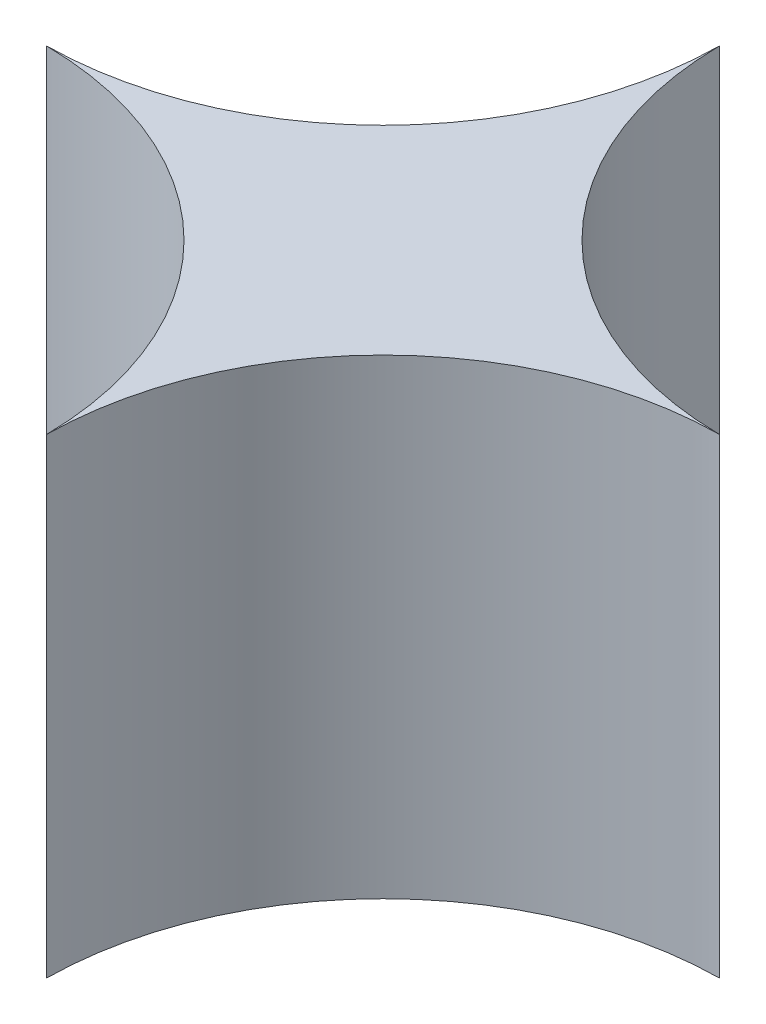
ISO-10303-21;
HEADER;
FILE_DESCRIPTION(('STEP AP214'),'2;1');
FILE_NAME('part.step','',(''),(''),'','','');
FILE_SCHEMA(('AUTOMOTIVE_DESIGN { 1 0 10303 214 1 1 1 1 }'));
ENDSEC;
DATA;
#1=APPLICATION_CONTEXT('core data for automotive mechanical design processes');
#2=APPLICATION_PROTOCOL_DEFINITION('international standard','automotive_design',2000,#1);
#3=PRODUCT_CONTEXT('',#1,'mechanical');
#4=PRODUCT('Part','Part','',(#3));
#5=PRODUCT_RELATED_PRODUCT_CATEGORY('part','',(#4));
#6=PRODUCT_DEFINITION_FORMATION('','',#4);
#7=PRODUCT_DEFINITION_CONTEXT('part definition',#1,'design');
#8=PRODUCT_DEFINITION('design','',#6,#7);
#9=PRODUCT_DEFINITION_SHAPE('','',#8);
#10=(LENGTH_UNIT() NAMED_UNIT(*) SI_UNIT(.MILLI.,.METRE.));
#11=(NAMED_UNIT(*) PLANE_ANGLE_UNIT() SI_UNIT($,.RADIAN.));
#12=(NAMED_UNIT(*) SI_UNIT($,.STERADIAN.) SOLID_ANGLE_UNIT());
#13=UNCERTAINTY_MEASURE_WITH_UNIT(LENGTH_MEASURE(1.E-05),#10,'distance_accuracy_value','');
#14=(GEOMETRIC_REPRESENTATION_CONTEXT(3) GLOBAL_UNCERTAINTY_ASSIGNED_CONTEXT((#13)) GLOBAL_UNIT_ASSIGNED_CONTEXT((#10,
#11,#12)) REPRESENTATION_CONTEXT('',''));
#15=CARTESIAN_POINT('',(0.,0.,0.));
#16=DIRECTION('',(0.,0.,1.));
#17=DIRECTION('',(1.,0.,0.));
#18=AXIS2_PLACEMENT_3D('',#15,#16,#17);
#19=CARTESIAN_POINT('',(-22.725,33.25,22.725));
#20=DIRECTION('',(0.,-1.,0.));
#21=DIRECTION('',(0.,0.,-1.));
#22=AXIS2_PLACEMENT_3D('',#19,#20,#21);
#23=CYLINDRICAL_SURFACE('',#22,22.725);
#24=CARTESIAN_POINT('',(-22.725,1.75,22.725));
#25=DIRECTION('',(0.,1.,0.));
#26=DIRECTION('',(0.,0.,1.));
#27=AXIS2_PLACEMENT_3D('',#24,#25,#26);
#28=CIRCLE('',#27,22.725);
#29=CARTESIAN_POINT('',(-0.00111388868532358,1.75,22.5));
#30=VERTEX_POINT('',#29);
#31=CARTESIAN_POINT('',(-22.5,1.75,0.00111388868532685));
#32=VERTEX_POINT('',#31);
#33=EDGE_CURVE('E140',#30,#32,#28,.T.);
#34=ORIENTED_EDGE('',*,*,#33,.F.);
#35=DIRECTION('',(0.,-1.,0.));
#36=VECTOR('',#35,1.);
#37=CARTESIAN_POINT('',(-0.00111388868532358,33.25,22.5));
#38=LINE('',#37,#36);
#39=CARTESIAN_POINT('',(-0.00111388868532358,33.25,22.5));
#40=VERTEX_POINT('',#39);
#41=EDGE_CURVE('E11',#40,#30,#38,.T.);
#42=ORIENTED_EDGE('',*,*,#41,.F.);
#43=CARTESIAN_POINT('',(-22.725,33.25,22.725));
#44=DIRECTION('',(0.,1.,0.));
#45=DIRECTION('',(0.,0.,1.));
#46=AXIS2_PLACEMENT_3D('',#43,#44,#45);
#47=CIRCLE('',#46,22.725);
#48=CARTESIAN_POINT('',(-22.5,33.25,0.00111388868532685));
#49=VERTEX_POINT('',#48);
#50=EDGE_CURVE('E168',#40,#49,#47,.T.);
#51=ORIENTED_EDGE('',*,*,#50,.T.);
#52=DIRECTION('',(0.,-1.,0.));
#53=VECTOR('',#52,1.);
#54=CARTESIAN_POINT('',(-22.5,33.25,0.00111388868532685));
#55=LINE('',#54,#53);
#56=EDGE_CURVE('E59',#49,#32,#55,.T.);
#57=ORIENTED_EDGE('',*,*,#56,.T.);
#58=EDGE_LOOP('',(#34,#42,#51,#57));
#59=FACE_BOUND('',#58,.T.);
#60=ADVANCED_FACE('F42',(#59),#23,.F.);
#61=CARTESIAN_POINT('',(0.,33.25,22.5));
#62=DIRECTION('',(0.,0.,-1.));
#63=DIRECTION('',(-1.,0.,0.));
#64=AXIS2_PLACEMENT_3D('',#61,#62,#63);
#65=PLANE('',#64);
#66=DIRECTION('',(1.,0.,0.));
#67=VECTOR('',#66,1.);
#68=CARTESIAN_POINT('',(0.,1.75,22.5));
#69=LINE('',#68,#67);
#70=CARTESIAN_POINT('',(0.00111388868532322,1.75,22.5));
#71=VERTEX_POINT('',#70);
#72=EDGE_CURVE('E143',#30,#71,#69,.T.);
#73=ORIENTED_EDGE('',*,*,#72,.T.);
#74=DIRECTION('',(0.,-1.,0.));
#75=VECTOR('',#74,1.);
#76=CARTESIAN_POINT('',(0.00111388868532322,33.25,22.5));
#77=LINE('',#76,#75);
#78=CARTESIAN_POINT('',(0.00111388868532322,33.25,22.5));
#79=VERTEX_POINT('',#78);
#80=EDGE_CURVE('E51',#79,#71,#77,.T.);
#81=ORIENTED_EDGE('',*,*,#80,.F.);
#82=DIRECTION('',(1.,0.,0.));
#83=VECTOR('',#82,1.);
#84=CARTESIAN_POINT('',(0.,33.25,22.5));
#85=LINE('',#84,#83);
#86=EDGE_CURVE('E202',#40,#79,#85,.T.);
#87=ORIENTED_EDGE('',*,*,#86,.F.);
#88=ORIENTED_EDGE('',*,*,#41,.T.);
#89=EDGE_LOOP('',(#73,#81,#87,#88));
#90=FACE_BOUND('',#89,.T.);
#91=ADVANCED_FACE('F190',(#90),#65,.F.);
#92=CARTESIAN_POINT('',(22.725,33.25,22.725));
#93=DIRECTION('',(0.,-1.,0.));
#94=DIRECTION('',(0.,0.,-1.));
#95=AXIS2_PLACEMENT_3D('',#92,#93,#94);
#96=CYLINDRICAL_SURFACE('',#95,22.725);
#97=CARTESIAN_POINT('',(22.725,1.75,22.725));
#98=DIRECTION('',(0.,1.,0.));
#99=DIRECTION('',(0.,0.,1.));
#100=AXIS2_PLACEMENT_3D('',#97,#98,#99);
#101=CIRCLE('',#100,22.725);
#102=CARTESIAN_POINT('',(22.5,1.75,0.00111388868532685));
#103=VERTEX_POINT('',#102);
#104=EDGE_CURVE('E147',#103,#71,#101,.T.);
#105=ORIENTED_EDGE('',*,*,#104,.F.);
#106=DIRECTION('',(0.,-1.,0.));
#107=VECTOR('',#106,1.);
#108=CARTESIAN_POINT('',(22.5,33.25,0.00111388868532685));
#109=LINE('',#108,#107);
#110=CARTESIAN_POINT('',(22.5,33.25,0.00111388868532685));
#111=VERTEX_POINT('',#110);
#112=EDGE_CURVE('E178',#111,#103,#109,.T.);
#113=ORIENTED_EDGE('',*,*,#112,.F.);
#114=CARTESIAN_POINT('',(22.725,33.25,22.725));
#115=DIRECTION('',(0.,1.,0.));
#116=DIRECTION('',(0.,0.,1.));
#117=AXIS2_PLACEMENT_3D('',#114,#115,#116);
#118=CIRCLE('',#117,22.725);
#119=EDGE_CURVE('E187',#111,#79,#118,.T.);
#120=ORIENTED_EDGE('',*,*,#119,.T.);
#121=ORIENTED_EDGE('',*,*,#80,.T.);
#122=EDGE_LOOP('',(#105,#113,#120,#121));
#123=FACE_BOUND('',#122,.T.);
#124=ADVANCED_FACE('F185',(#123),#96,.F.);
#125=CARTESIAN_POINT('',(22.5,33.25,0.));
#126=DIRECTION('',(-1.,0.,0.));
#127=DIRECTION('',(0.,0.,1.));
#128=AXIS2_PLACEMENT_3D('',#125,#126,#127);
#129=PLANE('',#128);
#130=DIRECTION('',(0.,0.,-1.));
#131=VECTOR('',#130,1.);
#132=CARTESIAN_POINT('',(22.5,1.75,0.));
#133=LINE('',#132,#131);
#134=CARTESIAN_POINT('',(22.5,1.75,-0.00111388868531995));
#135=VERTEX_POINT('',#134);
#136=EDGE_CURVE('E151',#103,#135,#133,.T.);
#137=ORIENTED_EDGE('',*,*,#136,.T.);
#138=DIRECTION('',(0.,-1.,0.));
#139=VECTOR('',#138,1.);
#140=CARTESIAN_POINT('',(22.5,33.25,-0.00111388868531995));
#141=LINE('',#140,#139);
#142=CARTESIAN_POINT('',(22.5,33.25,-0.00111388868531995));
#143=VERTEX_POINT('',#142);
#144=EDGE_CURVE('E175',#143,#135,#141,.T.);
#145=ORIENTED_EDGE('',*,*,#144,.F.);
#146=DIRECTION('',(0.,0.,-1.));
#147=VECTOR('',#146,1.);
#148=CARTESIAN_POINT('',(22.5,33.25,0.));
#149=LINE('',#148,#147);
#150=EDGE_CURVE('E199',#111,#143,#149,.T.);
#151=ORIENTED_EDGE('',*,*,#150,.F.);
#152=ORIENTED_EDGE('',*,*,#112,.T.);
#153=EDGE_LOOP('',(#137,#145,#151,#152));
#154=FACE_BOUND('',#153,.T.);
#155=ADVANCED_FACE('F197',(#154),#129,.F.);
#156=CARTESIAN_POINT('',(22.725,33.25,-22.725));
#157=DIRECTION('',(0.,-1.,0.));
#158=DIRECTION('',(0.,0.,-1.));
#159=AXIS2_PLACEMENT_3D('',#156,#157,#158);
#160=CYLINDRICAL_SURFACE('',#159,22.725);
#161=CARTESIAN_POINT('',(22.725,1.75,-22.725));
#162=DIRECTION('',(0.,1.,0.));
#163=DIRECTION('',(0.,0.,1.));
#164=AXIS2_PLACEMENT_3D('',#161,#162,#163);
#165=CIRCLE('',#164,22.725);
#166=CARTESIAN_POINT('',(0.00111388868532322,1.75,-22.5));
#167=VERTEX_POINT('',#166);
#168=EDGE_CURVE('E155',#167,#135,#165,.T.);
#169=ORIENTED_EDGE('',*,*,#168,.F.);
#170=DIRECTION('',(0.,-1.,0.));
#171=VECTOR('',#170,1.);
#172=CARTESIAN_POINT('',(0.00111388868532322,33.25,-22.5));
#173=LINE('',#172,#171);
#174=CARTESIAN_POINT('',(0.00111388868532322,33.25,-22.5));
#175=VERTEX_POINT('',#174);
#176=EDGE_CURVE('E119',#175,#167,#173,.T.);
#177=ORIENTED_EDGE('',*,*,#176,.F.);
#178=CARTESIAN_POINT('',(22.725,33.25,-22.725));
#179=DIRECTION('',(0.,1.,0.));
#180=DIRECTION('',(0.,0.,1.));
#181=AXIS2_PLACEMENT_3D('',#178,#179,#180);
#182=CIRCLE('',#181,22.725);
#183=EDGE_CURVE('E129',#175,#143,#182,.T.);
#184=ORIENTED_EDGE('',*,*,#183,.T.);
#185=ORIENTED_EDGE('',*,*,#144,.T.);
#186=EDGE_LOOP('',(#169,#177,#184,#185));
#187=FACE_BOUND('',#186,.T.);
#188=ADVANCED_FACE('F210',(#187),#160,.F.);
#189=CARTESIAN_POINT('',(0.,33.25,-22.5));
#190=DIRECTION('',(0.,0.,-1.));
#191=DIRECTION('',(-1.,0.,0.));
#192=AXIS2_PLACEMENT_3D('',#189,#190,#191);
#193=PLANE('',#192);
#194=DIRECTION('',(1.,0.,0.));
#195=VECTOR('',#194,1.);
#196=CARTESIAN_POINT('',(0.,1.75,-22.5));
#197=LINE('',#196,#195);
#198=CARTESIAN_POINT('',(-0.00111388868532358,1.75,-22.5));
#199=VERTEX_POINT('',#198);
#200=EDGE_CURVE('E114',#199,#167,#197,.T.);
#201=ORIENTED_EDGE('',*,*,#200,.F.);
#202=DIRECTION('',(0.,-1.,0.));
#203=VECTOR('',#202,1.);
#204=CARTESIAN_POINT('',(-0.00111388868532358,33.25,-22.5));
#205=LINE('',#204,#203);
#206=CARTESIAN_POINT('',(-0.00111388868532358,33.25,-22.5));
#207=VERTEX_POINT('',#206);
#208=EDGE_CURVE('E109',#207,#199,#205,.T.);
#209=ORIENTED_EDGE('',*,*,#208,.F.);
#210=DIRECTION('',(1.,0.,0.));
#211=VECTOR('',#210,1.);
#212=CARTESIAN_POINT('',(0.,33.25,-22.5));
#213=LINE('',#212,#211);
#214=EDGE_CURVE('E112',#207,#175,#213,.T.);
#215=ORIENTED_EDGE('',*,*,#214,.T.);
#216=ORIENTED_EDGE('',*,*,#176,.T.);
#217=EDGE_LOOP('',(#201,#209,#215,#216));
#218=FACE_BOUND('',#217,.T.);
#219=ADVANCED_FACE('F111',(#218),#193,.T.);
#220=CARTESIAN_POINT('',(-22.725,33.25,-22.725));
#221=DIRECTION('',(0.,-1.,0.));
#222=DIRECTION('',(0.,0.,-1.));
#223=AXIS2_PLACEMENT_3D('',#220,#221,#222);
#224=CYLINDRICAL_SURFACE('',#223,22.725);
#225=CARTESIAN_POINT('',(-22.725,1.75,-22.725));
#226=DIRECTION('',(0.,1.,0.));
#227=DIRECTION('',(0.,0.,1.));
#228=AXIS2_PLACEMENT_3D('',#225,#226,#227);
#229=CIRCLE('',#228,22.725);
#230=CARTESIAN_POINT('',(-22.5,1.75,-0.00111388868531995));
#231=VERTEX_POINT('',#230);
#232=EDGE_CURVE('E161',#231,#199,#229,.T.);
#233=ORIENTED_EDGE('',*,*,#232,.F.);
#234=DIRECTION('',(0.,-1.,0.));
#235=VECTOR('',#234,1.);
#236=CARTESIAN_POINT('',(-22.5,33.25,-0.00111388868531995));
#237=LINE('',#236,#235);
#238=CARTESIAN_POINT('',(-22.5,33.25,-0.00111388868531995));
#239=VERTEX_POINT('',#238);
#240=EDGE_CURVE('E84',#239,#231,#237,.T.);
#241=ORIENTED_EDGE('',*,*,#240,.F.);
#242=CARTESIAN_POINT('',(-22.725,33.25,-22.725));
#243=DIRECTION('',(0.,1.,0.));
#244=DIRECTION('',(0.,0.,1.));
#245=AXIS2_PLACEMENT_3D('',#242,#243,#244);
#246=CIRCLE('',#245,22.725);
#247=EDGE_CURVE('E127',#239,#207,#246,.T.);
#248=ORIENTED_EDGE('',*,*,#247,.T.);
#249=ORIENTED_EDGE('',*,*,#208,.T.);
#250=EDGE_LOOP('',(#233,#241,#248,#249));
#251=FACE_BOUND('',#250,.T.);
#252=ADVANCED_FACE('F132',(#251),#224,.F.);
#253=CARTESIAN_POINT('',(-22.5,33.25,0.));
#254=DIRECTION('',(-1.,0.,0.));
#255=DIRECTION('',(0.,0.,1.));
#256=AXIS2_PLACEMENT_3D('',#253,#254,#255);
#257=PLANE('',#256);
#258=DIRECTION('',(0.,0.,-1.));
#259=VECTOR('',#258,1.);
#260=CARTESIAN_POINT('',(-22.5,1.75,0.));
#261=LINE('',#260,#259);
#262=EDGE_CURVE('E164',#32,#231,#261,.T.);
#263=ORIENTED_EDGE('',*,*,#262,.F.);
#264=ORIENTED_EDGE('',*,*,#56,.F.);
#265=DIRECTION('',(0.,0.,-1.));
#266=VECTOR('',#265,1.);
#267=CARTESIAN_POINT('',(-22.5,33.25,0.));
#268=LINE('',#267,#266);
#269=EDGE_CURVE('E134',#49,#239,#268,.T.);
#270=ORIENTED_EDGE('',*,*,#269,.T.);
#271=ORIENTED_EDGE('',*,*,#240,.T.);
#272=EDGE_LOOP('',(#263,#264,#270,#271));
#273=FACE_BOUND('',#272,.T.);
#274=ADVANCED_FACE('F211',(#273),#257,.T.);
#275=CARTESIAN_POINT('',(0.,33.25,0.));
#276=DIRECTION('',(0.,1.,0.));
#277=DIRECTION('',(0.,0.,1.));
#278=AXIS2_PLACEMENT_3D('',#275,#276,#277);
#279=PLANE('',#278);
#280=ORIENTED_EDGE('',*,*,#50,.F.);
#281=ORIENTED_EDGE('',*,*,#86,.T.);
#282=ORIENTED_EDGE('',*,*,#119,.F.);
#283=ORIENTED_EDGE('',*,*,#150,.T.);
#284=ORIENTED_EDGE('',*,*,#183,.F.);
#285=ORIENTED_EDGE('',*,*,#214,.F.);
#286=ORIENTED_EDGE('',*,*,#247,.F.);
#287=ORIENTED_EDGE('',*,*,#269,.F.);
#288=EDGE_LOOP('',(#280,#281,#282,#283,#284,#285,#286,#287));
#289=FACE_BOUND('',#288,.T.);
#290=ADVANCED_FACE('F125',(#289),#279,.T.);
#291=CARTESIAN_POINT('',(0.,1.75,0.));
#292=DIRECTION('',(0.,1.,0.));
#293=DIRECTION('',(0.,0.,1.));
#294=AXIS2_PLACEMENT_3D('',#291,#292,#293);
#295=PLANE('',#294);
#296=ORIENTED_EDGE('',*,*,#33,.T.);
#297=ORIENTED_EDGE('',*,*,#262,.T.);
#298=ORIENTED_EDGE('',*,*,#232,.T.);
#299=ORIENTED_EDGE('',*,*,#200,.T.);
#300=ORIENTED_EDGE('',*,*,#168,.T.);
#301=ORIENTED_EDGE('',*,*,#136,.F.);
#302=ORIENTED_EDGE('',*,*,#104,.T.);
#303=ORIENTED_EDGE('',*,*,#72,.F.);
#304=EDGE_LOOP('',(#296,#297,#298,#299,#300,#301,#302,#303));
#305=FACE_BOUND('',#304,.T.);
#306=ADVANCED_FACE('F193',(#305),#295,.F.);
#307=CLOSED_SHELL('',(#60,#91,#124,#155,#188,#219,#252,#274,#290,#306));
#308=MANIFOLD_SOLID_BREP('B2',#307);
#309=ADVANCED_BREP_SHAPE_REPRESENTATION('',(#18,#308),#14);
#310=SHAPE_DEFINITION_REPRESENTATION(#9,#309);
ENDSEC;
END-ISO-10303-21;
